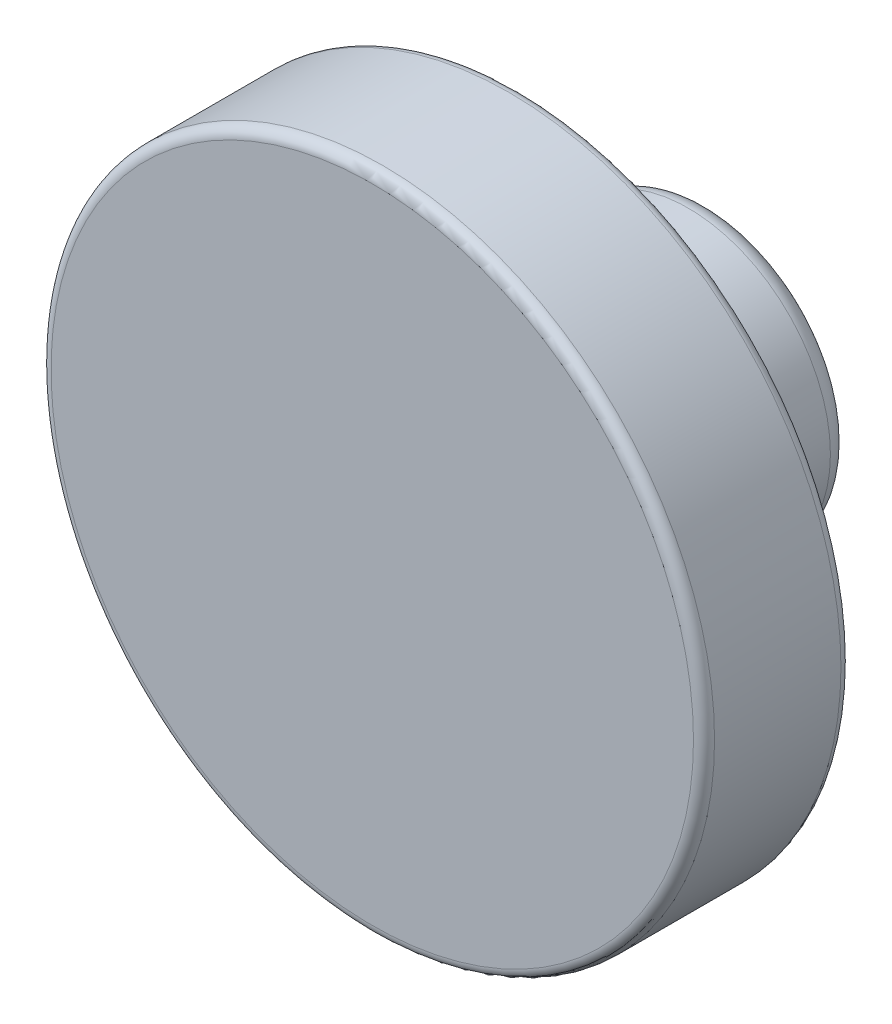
ISO-10303-21;
HEADER;
FILE_DESCRIPTION(('STEP AP214'),'2;1');
FILE_NAME('part.step','',(''),(''),'','','');
FILE_SCHEMA(('AUTOMOTIVE_DESIGN { 1 0 10303 214 1 1 1 1 }'));
ENDSEC;
DATA;
#1=APPLICATION_CONTEXT('core data for automotive mechanical design processes');
#2=APPLICATION_PROTOCOL_DEFINITION('international standard','automotive_design',2000,#1);
#3=PRODUCT_CONTEXT('',#1,'mechanical');
#4=PRODUCT('Part','Part','',(#3));
#5=PRODUCT_RELATED_PRODUCT_CATEGORY('part','',(#4));
#6=PRODUCT_DEFINITION_FORMATION('','',#4);
#7=PRODUCT_DEFINITION_CONTEXT('part definition',#1,'design');
#8=PRODUCT_DEFINITION('design','',#6,#7);
#9=PRODUCT_DEFINITION_SHAPE('','',#8);
#10=(LENGTH_UNIT() NAMED_UNIT(*) SI_UNIT(.MILLI.,.METRE.));
#11=(NAMED_UNIT(*) PLANE_ANGLE_UNIT() SI_UNIT($,.RADIAN.));
#12=(NAMED_UNIT(*) SI_UNIT($,.STERADIAN.) SOLID_ANGLE_UNIT());
#13=UNCERTAINTY_MEASURE_WITH_UNIT(LENGTH_MEASURE(1.E-05),#10,'distance_accuracy_value','');
#14=(GEOMETRIC_REPRESENTATION_CONTEXT(3) GLOBAL_UNCERTAINTY_ASSIGNED_CONTEXT((#13)) GLOBAL_UNIT_ASSIGNED_CONTEXT((#10,
#11,#12)) REPRESENTATION_CONTEXT('',''));
#15=CARTESIAN_POINT('',(0.,0.,0.));
#16=DIRECTION('',(0.,0.,1.));
#17=DIRECTION('',(1.,0.,0.));
#18=AXIS2_PLACEMENT_3D('',#15,#16,#17);
#19=CARTESIAN_POINT('',(0.,6.,22.));
#20=DIRECTION('',(0.,0.,1.));
#21=DIRECTION('',(1.,0.,0.));
#22=AXIS2_PLACEMENT_3D('',#19,#20,#21);
#23=PLANE('',#22);
#24=CARTESIAN_POINT('',(0.,0.,22.));
#25=DIRECTION('',(0.,0.,1.));
#26=DIRECTION('',(1.,0.,0.));
#27=AXIS2_PLACEMENT_3D('',#24,#25,#26);
#28=CIRCLE('',#27,6.);
#29=CARTESIAN_POINT('',(6.,0.,22.));
#30=VERTEX_POINT('',#29);
#31=EDGE_CURVE('E8',#30,#30,#28,.T.);
#32=ORIENTED_EDGE('',*,*,#31,.F.);
#33=EDGE_LOOP('',(#32));
#34=FACE_BOUND('',#33,.T.);
#35=ADVANCED_FACE('F12',(#34),#23,.F.);
#36=CARTESIAN_POINT('',(0.,0.,37.));
#37=DIRECTION('',(0.,0.,1.));
#38=DIRECTION('',(1.,0.,0.));
#39=AXIS2_PLACEMENT_3D('',#36,#37,#38);
#40=CYLINDRICAL_SURFACE('',#39,6.);
#41=CARTESIAN_POINT('',(0.,0.,0.));
#42=DIRECTION('',(0.,0.,1.));
#43=DIRECTION('',(1.,0.,0.));
#44=AXIS2_PLACEMENT_3D('',#41,#42,#43);
#45=CIRCLE('',#44,6.);
#46=CARTESIAN_POINT('',(6.,0.,0.));
#47=VERTEX_POINT('',#46);
#48=EDGE_CURVE('E18',#47,#47,#45,.T.);
#49=ORIENTED_EDGE('',*,*,#48,.F.);
#50=EDGE_LOOP('',(#49));
#51=FACE_BOUND('',#50,.T.);
#52=ORIENTED_EDGE('',*,*,#31,.T.);
#53=EDGE_LOOP('',(#52));
#54=FACE_BOUND('',#53,.T.);
#55=ADVANCED_FACE('F96',(#51,#54),#40,.F.);
#56=CARTESIAN_POINT('',(0.,11.5,0.));
#57=DIRECTION('',(0.,0.,1.));
#58=DIRECTION('',(1.,0.,0.));
#59=AXIS2_PLACEMENT_3D('',#56,#57,#58);
#60=PLANE('',#59);
#61=CARTESIAN_POINT('',(0.,0.,0.));
#62=DIRECTION('',(0.,0.,1.));
#63=DIRECTION('',(1.,0.,0.));
#64=AXIS2_PLACEMENT_3D('',#61,#62,#63);
#65=CIRCLE('',#64,11.5);
#66=CARTESIAN_POINT('',(11.5,0.,0.));
#67=VERTEX_POINT('',#66);
#68=EDGE_CURVE('E22',#67,#67,#65,.T.);
#69=ORIENTED_EDGE('',*,*,#68,.F.);
#70=EDGE_LOOP('',(#69));
#71=FACE_BOUND('',#70,.T.);
#72=ORIENTED_EDGE('',*,*,#48,.T.);
#73=EDGE_LOOP('',(#72));
#74=FACE_BOUND('',#73,.T.);
#75=ADVANCED_FACE('F91',(#71,#74),#60,.F.);
#76=CARTESIAN_POINT('',(0.,0.,2.));
#77=DIRECTION('',(0.,0.,1.));
#78=DIRECTION('',(1.,0.,0.));
#79=AXIS2_PLACEMENT_3D('',#76,#77,#78);
#80=TOROIDAL_SURFACE('',#79,11.5,2.);
#81=CARTESIAN_POINT('',(0.,0.,2.));
#82=DIRECTION('',(0.,0.,1.));
#83=DIRECTION('',(1.,0.,0.));
#84=AXIS2_PLACEMENT_3D('',#81,#82,#83);
#85=CIRCLE('',#84,13.5);
#86=CARTESIAN_POINT('',(13.5,0.,2.));
#87=VERTEX_POINT('',#86);
#88=EDGE_CURVE('E26',#87,#87,#85,.T.);
#89=ORIENTED_EDGE('',*,*,#88,.F.);
#90=EDGE_LOOP('',(#89));
#91=FACE_BOUND('',#90,.T.);
#92=ORIENTED_EDGE('',*,*,#68,.T.);
#93=EDGE_LOOP('',(#92));
#94=FACE_BOUND('',#93,.T.);
#95=ADVANCED_FACE('F85',(#91,#94),#80,.T.);
#96=CARTESIAN_POINT('',(0.,0.,37.));
#97=DIRECTION('',(0.,0.,1.));
#98=DIRECTION('',(1.,0.,0.));
#99=AXIS2_PLACEMENT_3D('',#96,#97,#98);
#100=CYLINDRICAL_SURFACE('',#99,13.5);
#101=CARTESIAN_POINT('',(0.,0.,15.));
#102=DIRECTION('',(0.,0.,1.));
#103=DIRECTION('',(1.,0.,0.));
#104=AXIS2_PLACEMENT_3D('',#101,#102,#103);
#105=CIRCLE('',#104,13.5);
#106=CARTESIAN_POINT('',(13.5,0.,15.));
#107=VERTEX_POINT('',#106);
#108=EDGE_CURVE('E31',#107,#107,#105,.T.);
#109=ORIENTED_EDGE('',*,*,#108,.F.);
#110=EDGE_LOOP('',(#109));
#111=FACE_BOUND('',#110,.T.);
#112=ORIENTED_EDGE('',*,*,#88,.T.);
#113=EDGE_LOOP('',(#112));
#114=FACE_BOUND('',#113,.T.);
#115=ADVANCED_FACE('F79',(#111,#114),#100,.T.);
#116=CARTESIAN_POINT('',(0.,0.,15.));
#117=DIRECTION('',(0.,0.,1.));
#118=DIRECTION('',(1.,0.,0.));
#119=AXIS2_PLACEMENT_3D('',#116,#117,#118);
#120=TOROIDAL_SURFACE('',#119,16.5,3.);
#121=CARTESIAN_POINT('',(0.,0.,18.));
#122=DIRECTION('',(0.,0.,1.));
#123=DIRECTION('',(1.,0.,0.));
#124=AXIS2_PLACEMENT_3D('',#121,#122,#123);
#125=CIRCLE('',#124,16.5);
#126=CARTESIAN_POINT('',(16.5,0.,18.));
#127=VERTEX_POINT('',#126);
#128=EDGE_CURVE('E34',#127,#127,#125,.T.);
#129=ORIENTED_EDGE('',*,*,#128,.F.);
#130=EDGE_LOOP('',(#129));
#131=FACE_BOUND('',#130,.T.);
#132=ORIENTED_EDGE('',*,*,#108,.T.);
#133=EDGE_LOOP('',(#132));
#134=FACE_BOUND('',#133,.T.);
#135=ADVANCED_FACE('F73',(#131,#134),#120,.F.);
#136=CARTESIAN_POINT('',(0.,30.5,18.));
#137=DIRECTION('',(0.,0.,1.));
#138=DIRECTION('',(1.,0.,0.));
#139=AXIS2_PLACEMENT_3D('',#136,#137,#138);
#140=PLANE('',#139);
#141=CARTESIAN_POINT('',(0.,0.,18.));
#142=DIRECTION('',(0.,0.,1.));
#143=DIRECTION('',(1.,0.,0.));
#144=AXIS2_PLACEMENT_3D('',#141,#142,#143);
#145=CIRCLE('',#144,30.5);
#146=CARTESIAN_POINT('',(30.5,0.,18.));
#147=VERTEX_POINT('',#146);
#148=EDGE_CURVE('E37',#147,#147,#145,.T.);
#149=ORIENTED_EDGE('',*,*,#148,.F.);
#150=EDGE_LOOP('',(#149));
#151=FACE_BOUND('',#150,.T.);
#152=ORIENTED_EDGE('',*,*,#128,.T.);
#153=EDGE_LOOP('',(#152));
#154=FACE_BOUND('',#153,.T.);
#155=ADVANCED_FACE('F67',(#151,#154),#140,.F.);
#156=CARTESIAN_POINT('',(0.,0.,19.));
#157=DIRECTION('',(0.,0.,1.));
#158=DIRECTION('',(1.,0.,0.));
#159=AXIS2_PLACEMENT_3D('',#156,#157,#158);
#160=TOROIDAL_SURFACE('',#159,30.5,1.);
#161=CARTESIAN_POINT('',(0.,0.,19.));
#162=DIRECTION('',(0.,0.,1.));
#163=DIRECTION('',(1.,0.,0.));
#164=AXIS2_PLACEMENT_3D('',#161,#162,#163);
#165=CIRCLE('',#164,31.5);
#166=CARTESIAN_POINT('',(31.5,0.,19.));
#167=VERTEX_POINT('',#166);
#168=EDGE_CURVE('E40',#167,#167,#165,.T.);
#169=ORIENTED_EDGE('',*,*,#168,.F.);
#170=EDGE_LOOP('',(#169));
#171=FACE_BOUND('',#170,.T.);
#172=ORIENTED_EDGE('',*,*,#148,.T.);
#173=EDGE_LOOP('',(#172));
#174=FACE_BOUND('',#173,.T.);
#175=ADVANCED_FACE('F61',(#171,#174),#160,.T.);
#176=CARTESIAN_POINT('',(0.,0.,37.));
#177=DIRECTION('',(0.,0.,1.));
#178=DIRECTION('',(1.,0.,0.));
#179=AXIS2_PLACEMENT_3D('',#176,#177,#178);
#180=CYLINDRICAL_SURFACE('',#179,31.5);
#181=CARTESIAN_POINT('',(0.,0.,31.));
#182=DIRECTION('',(0.,0.,1.));
#183=DIRECTION('',(1.,0.,0.));
#184=AXIS2_PLACEMENT_3D('',#181,#182,#183);
#185=CIRCLE('',#184,31.5);
#186=CARTESIAN_POINT('',(31.5,0.,31.));
#187=VERTEX_POINT('',#186);
#188=EDGE_CURVE('E43',#187,#187,#185,.T.);
#189=ORIENTED_EDGE('',*,*,#188,.F.);
#190=EDGE_LOOP('',(#189));
#191=FACE_BOUND('',#190,.T.);
#192=ORIENTED_EDGE('',*,*,#168,.T.);
#193=EDGE_LOOP('',(#192));
#194=FACE_BOUND('',#193,.T.);
#195=ADVANCED_FACE('F55',(#191,#194),#180,.T.);
#196=CARTESIAN_POINT('',(0.,0.,31.));
#197=DIRECTION('',(0.,0.,1.));
#198=DIRECTION('',(1.,0.,0.));
#199=AXIS2_PLACEMENT_3D('',#196,#197,#198);
#200=TOROIDAL_SURFACE('',#199,30.5,1.);
#201=CARTESIAN_POINT('',(0.,0.,32.));
#202=DIRECTION('',(0.,0.,1.));
#203=DIRECTION('',(1.,0.,0.));
#204=AXIS2_PLACEMENT_3D('',#201,#202,#203);
#205=CIRCLE('',#204,30.5);
#206=CARTESIAN_POINT('',(30.5,0.,32.));
#207=VERTEX_POINT('',#206);
#208=EDGE_CURVE('E46',#207,#207,#205,.T.);
#209=ORIENTED_EDGE('',*,*,#208,.F.);
#210=EDGE_LOOP('',(#209));
#211=FACE_BOUND('',#210,.T.);
#212=ORIENTED_EDGE('',*,*,#188,.T.);
#213=EDGE_LOOP('',(#212));
#214=FACE_BOUND('',#213,.T.);
#215=ADVANCED_FACE('F52',(#211,#214),#200,.T.);
#216=CARTESIAN_POINT('',(0.,30.5,32.));
#217=DIRECTION('',(0.,0.,-1.));
#218=DIRECTION('',(-1.,0.,0.));
#219=AXIS2_PLACEMENT_3D('',#216,#217,#218);
#220=PLANE('',#219);
#221=ORIENTED_EDGE('',*,*,#208,.T.);
#222=EDGE_LOOP('',(#221));
#223=FACE_BOUND('',#222,.T.);
#224=ADVANCED_FACE('F50',(#223),#220,.F.);
#225=CLOSED_SHELL('',(#35,#55,#75,#95,#115,#135,#155,#175,#195,#215,#224));
#226=MANIFOLD_SOLID_BREP('B1',#225);
#227=ADVANCED_BREP_SHAPE_REPRESENTATION('',(#18,#226),#14);
#228=SHAPE_DEFINITION_REPRESENTATION(#9,#227);
ENDSEC;
END-ISO-10303-21;
